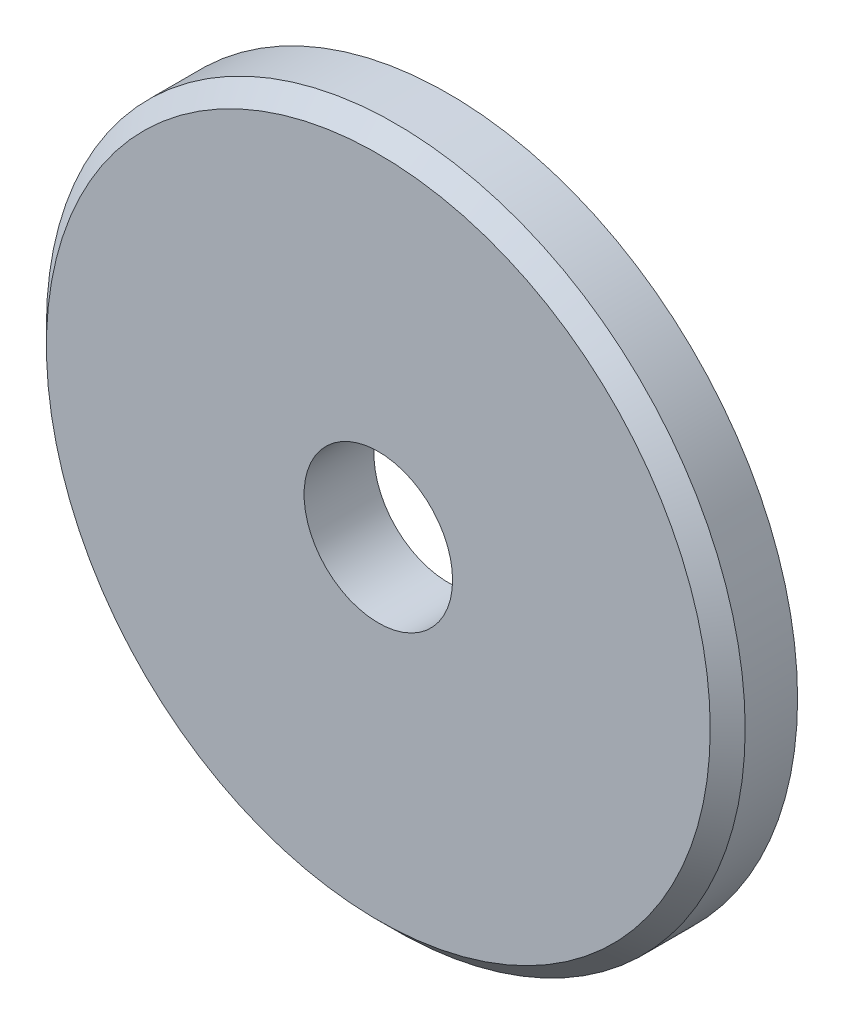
from build123d import *

# Parameters (mm, degrees)
ESQUISSE1_R      = 40
ESQUISSE1_R_2    = 8.5
EXTRUSION1_DEPTH = 8
CHANFREIN1_SIZE  = 2


with BuildPart() as part:
    # Esquisse1 → Extrusion1 (new body)
    with BuildSketch(Plane.XY):
        Circle(ESQUISSE1_R)
        Circle(ESQUISSE1_R_2, mode=Mode.SUBTRACT)
    extrude(amount=EXTRUSION1_DEPTH)

    # Chanfrein1
    chanfrein1_edges = [part.edges().sort_by_distance(p)[0] for p in [
        (-40, 0, 8),
    ]]
    chamfer(chanfrein1_edges, length=CHANFREIN1_SIZE)


solid = part.part
